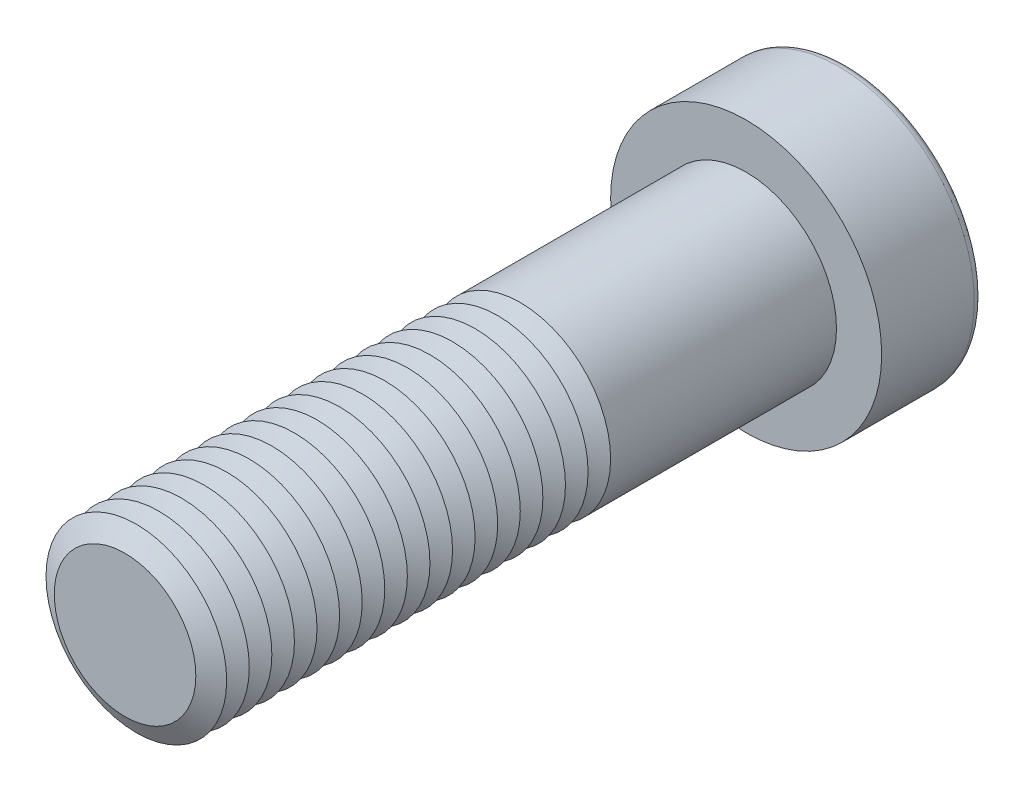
from build123d import *

# Parameters (mm, degrees)
SKETCH1_R           = 8
BOSS_EXTRUDE1_DEPTH = 55
SKETCH2_R           = 12
BOSS_EXTRUDE2_DEPTH = 9
CUT_EXTRUDE1_DEPTH  = 9
FILLET1_R           = 0.8
LPATTERN1_COUNT     = 18
LPATTERN1_PITCH     = 2


with BuildPart() as part:
    # Sketch1 → Boss-Extrude1 (new body)
    with BuildSketch(Plane.XY):
        Circle(SKETCH1_R)
    extrude(amount=BOSS_EXTRUDE1_DEPTH)

    # Sketch2 → Boss-Extrude2 (add)
    with BuildSketch(Plane(origin=(0, 0, 0), x_dir=(-1, 0, 0), z_dir=(0, 0, -1))):
        Circle(SKETCH2_R)
    extrude(amount=BOSS_EXTRUDE2_DEPTH)

    # Sketch3 → Cut-Extrude1 (cut)
    with BuildSketch(Plane(origin=(0, 0, -9), x_dir=(-1, 0, 0), z_dir=(0, 0, -1))):
        Polygon((-3.464101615, 6), (-6.92820323, 0), (-3.464101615, -6), (3.464101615, -6), (6.92820323, 0), (3.464101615, 6), align=None)
    extrude(amount=-CUT_EXTRUDE1_DEPTH, mode=Mode.SUBTRACT)

    # Fillet1
    fillet1_edges = [part.edges().sort_by_distance(p)[0] for p in [
        (12, 0, -9),
    ]]
    fillet(fillet1_edges, radius=FILLET1_R)

    # Cut-Extrude2 cone 1 section (on through the dimple's axis) → Cut-Extrude2 (revolve, cut)
    with BuildSketch(Plane.YZ):
        Polygon((0, 0), (6, 0), (0, 3.464101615), align=None)
    revolve(axis=Axis((0, 0, 0), (0, 0, 1)), mode=Mode.SUBTRACT)

    # Cut-Extrude3 cone 1 section (on through the dimple's axis) → Cut-Extrude3 (revolve, cut)
    with BuildSketch(Plane(origin=(0, 0, -9), x_dir=(0, 1, 0), z_dir=(1, 0, 0))):
        Polygon((0, 0), (6.92820323, 0), (0, 1.856406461), align=None)
    revolve(axis=Axis((0, 0, -9), (0, 0, 1)), mode=Mode.SUBTRACT)

    # Sketch7 → Cut-Revolve1 (revolve, cut)
    with BuildSketch(Plane(origin=(0, 0, 0), x_dir=(0, 0, -1), z_dir=(1, 0, 0)), mode=Mode.PRIVATE) as cut_revolve1_sk:
        Polygon((-55, 6.267949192), (-54, 8), (-56, 8), align=None)
    cut_revolve1 = revolve(cut_revolve1_sk.sketch.rotate(Axis((0, 0, 55), (0, 0, -1)), 90), axis=Axis((0, 0, 55), (0, 0, -1)), mode=Mode.SUBTRACT)

    # LPattern1: Cut-Revolve1 ×18
    with Locations(*[(0, 0, -i * LPATTERN1_PITCH) for i in range(1, LPATTERN1_COUNT)]):
        add(cut_revolve1, mode=Mode.SUBTRACT)


solid = part.part
